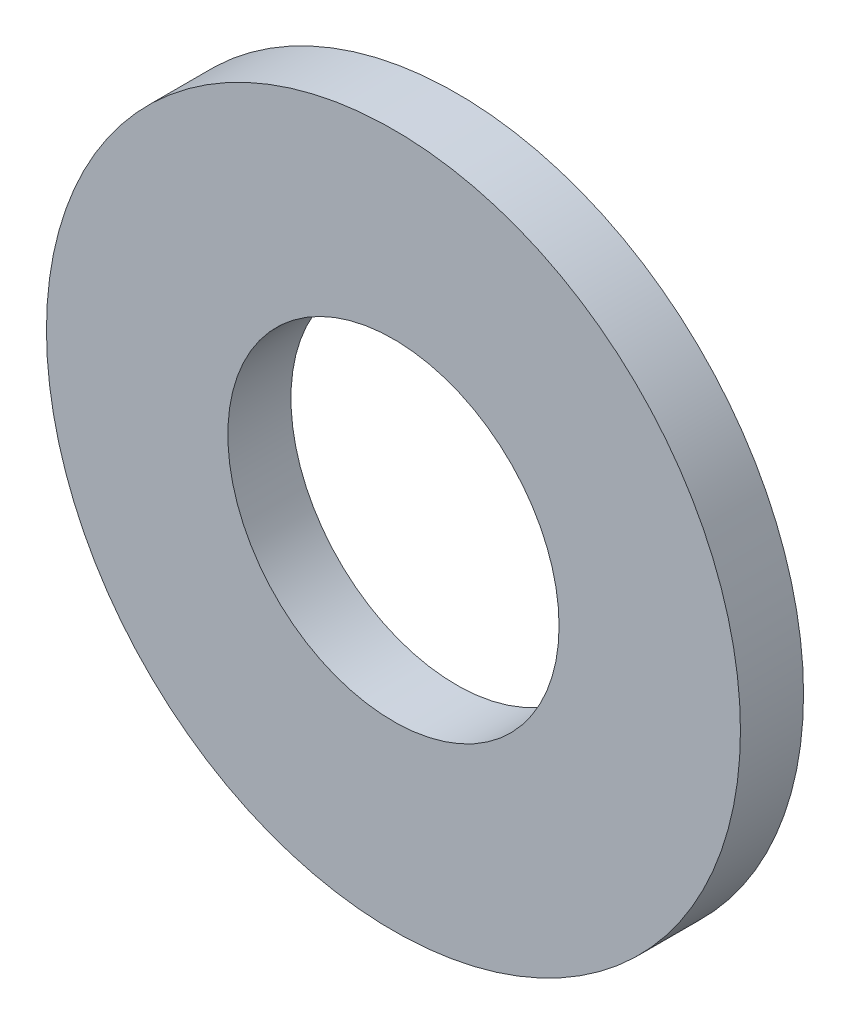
from build123d import *

# Parameters (mm, degrees)
ESQUISSE1_R      = 11
ESQUISSE1_R_2    = 5.25
EXTRUSION1_DEPTH = 2


with BuildPart() as part:
    # Esquisse1 → Extrusion1 (new body)
    with BuildSketch(Plane.XY):
        Circle(ESQUISSE1_R)
        Circle(ESQUISSE1_R_2, mode=Mode.SUBTRACT)
    extrude(amount=EXTRUSION1_DEPTH)


solid = part.part
